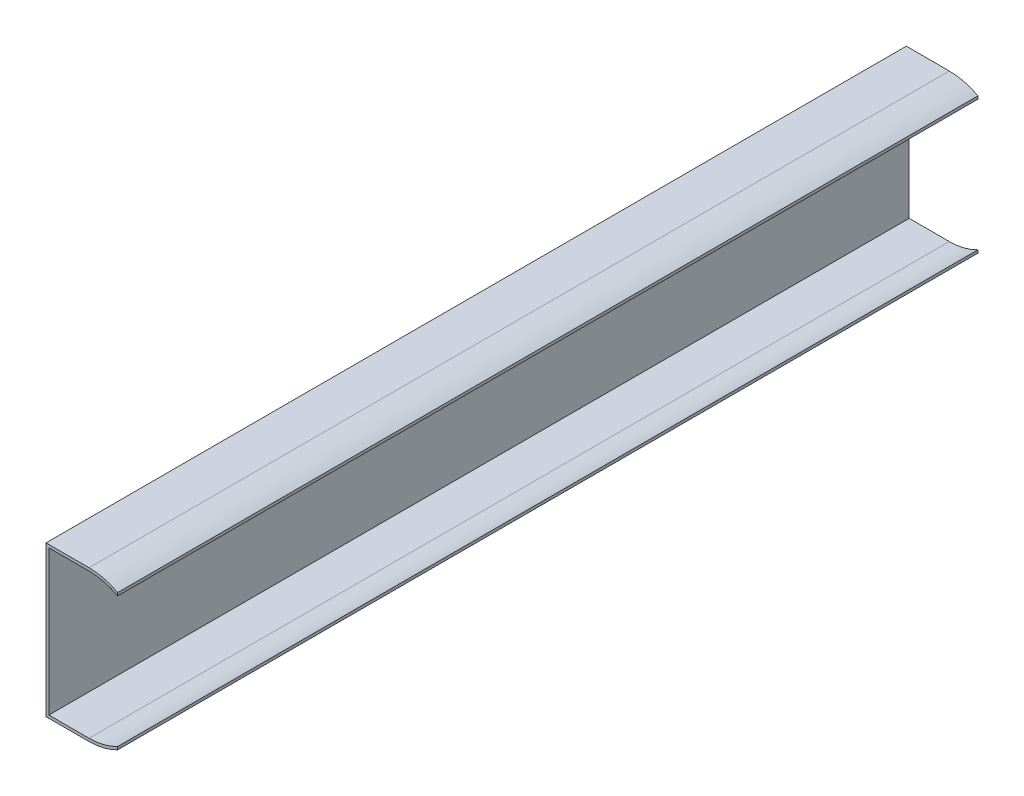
ISO-10303-21;
HEADER;
FILE_DESCRIPTION(('STEP AP214'),'2;1');
FILE_NAME('part.step','',(''),(''),'','','');
FILE_SCHEMA(('AUTOMOTIVE_DESIGN { 1 0 10303 214 1 1 1 1 }'));
ENDSEC;
DATA;
#1=APPLICATION_CONTEXT('core data for automotive mechanical design processes');
#2=APPLICATION_PROTOCOL_DEFINITION('international standard','automotive_design',2000,#1);
#3=PRODUCT_CONTEXT('',#1,'mechanical');
#4=PRODUCT('Part','Part','',(#3));
#5=PRODUCT_RELATED_PRODUCT_CATEGORY('part','',(#4));
#6=PRODUCT_DEFINITION_FORMATION('','',#4);
#7=PRODUCT_DEFINITION_CONTEXT('part definition',#1,'design');
#8=PRODUCT_DEFINITION('design','',#6,#7);
#9=PRODUCT_DEFINITION_SHAPE('','',#8);
#10=(LENGTH_UNIT() NAMED_UNIT(*) SI_UNIT(.MILLI.,.METRE.));
#11=(NAMED_UNIT(*) PLANE_ANGLE_UNIT() SI_UNIT($,.RADIAN.));
#12=(NAMED_UNIT(*) SI_UNIT($,.STERADIAN.) SOLID_ANGLE_UNIT());
#13=UNCERTAINTY_MEASURE_WITH_UNIT(LENGTH_MEASURE(1.E-05),#10,'distance_accuracy_value','');
#14=(GEOMETRIC_REPRESENTATION_CONTEXT(3) GLOBAL_UNCERTAINTY_ASSIGNED_CONTEXT((#13)) GLOBAL_UNIT_ASSIGNED_CONTEXT((#10,
#11,#12)) REPRESENTATION_CONTEXT('',''));
#15=CARTESIAN_POINT('',(0.,0.,0.));
#16=DIRECTION('',(0.,0.,1.));
#17=DIRECTION('',(1.,0.,0.));
#18=AXIS2_PLACEMENT_3D('',#15,#16,#17);
#19=CARTESIAN_POINT('',(0.,0.,600.));
#20=DIRECTION('',(0.,1.,0.));
#21=DIRECTION('',(0.,0.,1.));
#22=AXIS2_PLACEMENT_3D('',#19,#20,#21);
#23=PLANE('',#22);
#24=DIRECTION('',(1.,0.,0.));
#25=VECTOR('',#24,1.);
#26=CARTESIAN_POINT('',(0.,0.,0.));
#27=LINE('',#26,#25);
#28=CARTESIAN_POINT('',(0.,0.,0.));
#29=VERTEX_POINT('',#28);
#30=CARTESIAN_POINT('',(30.,0.,0.));
#31=VERTEX_POINT('',#30);
#32=EDGE_CURVE('E155',#29,#31,#27,.T.);
#33=ORIENTED_EDGE('',*,*,#32,.T.);
#34=DIRECTION('',(0.,0.,-1.));
#35=VECTOR('',#34,1.);
#36=CARTESIAN_POINT('',(30.,0.,600.));
#37=LINE('',#36,#35);
#38=CARTESIAN_POINT('',(30.,0.,600.));
#39=VERTEX_POINT('',#38);
#40=EDGE_CURVE('E11',#39,#31,#37,.T.);
#41=ORIENTED_EDGE('',*,*,#40,.F.);
#42=DIRECTION('',(1.,0.,0.));
#43=VECTOR('',#42,1.);
#44=CARTESIAN_POINT('',(0.,0.,600.));
#45=LINE('',#44,#43);
#46=CARTESIAN_POINT('',(0.,0.,600.));
#47=VERTEX_POINT('',#46);
#48=EDGE_CURVE('E197',#47,#39,#45,.T.);
#49=ORIENTED_EDGE('',*,*,#48,.F.);
#50=DIRECTION('',(0.,0.,-1.));
#51=VECTOR('',#50,1.);
#52=CARTESIAN_POINT('',(0.,0.,600.));
#53=LINE('',#52,#51);
#54=EDGE_CURVE('E148',#47,#29,#53,.T.);
#55=ORIENTED_EDGE('',*,*,#54,.T.);
#56=EDGE_LOOP('',(#33,#41,#49,#55));
#57=FACE_BOUND('',#56,.T.);
#58=ADVANCED_FACE('F32',(#57),#23,.F.);
#59=CARTESIAN_POINT('',(30.,0.,600.));
#60=CARTESIAN_POINT('',(40.6032812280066,0.0484567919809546,600.));
#61=CARTESIAN_POINT('',(50.,5.,600.));
#62=B_SPLINE_CURVE_WITH_KNOTS('',2,(#59,#60,#61),.UNSPECIFIED.,.F.,.F.,(3,3),(0.,1.),.UNSPECIFIED.);
#63=DIRECTION('',(0.,0.,-1.));
#64=VECTOR('',#63,1.);
#65=SURFACE_OF_LINEAR_EXTRUSION('',#62,#64);
#66=CARTESIAN_POINT('',(30.,0.,0.));
#67=CARTESIAN_POINT('',(40.6032812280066,0.0484567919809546,0.));
#68=CARTESIAN_POINT('',(50.,5.,0.));
#69=B_SPLINE_CURVE_WITH_KNOTS('',2,(#66,#67,#68),.UNSPECIFIED.,.F.,.F.,(3,3),(0.,1.),.UNSPECIFIED.);
#70=CARTESIAN_POINT('',(50.,5.,0.));
#71=VERTEX_POINT('',#70);
#72=EDGE_CURVE('E158',#31,#71,#69,.T.);
#73=ORIENTED_EDGE('',*,*,#72,.T.);
#74=DIRECTION('',(0.,0.,-1.));
#75=VECTOR('',#74,1.);
#76=CARTESIAN_POINT('',(50.,5.,600.));
#77=LINE('',#76,#75);
#78=CARTESIAN_POINT('',(50.,5.,600.));
#79=VERTEX_POINT('',#78);
#80=EDGE_CURVE('E40',#79,#71,#77,.T.);
#81=ORIENTED_EDGE('',*,*,#80,.F.);
#82=EDGE_CURVE('E103',#39,#79,#62,.T.);
#83=ORIENTED_EDGE('',*,*,#82,.F.);
#84=ORIENTED_EDGE('',*,*,#40,.T.);
#85=EDGE_LOOP('',(#73,#81,#83,#84));
#86=FACE_BOUND('',#85,.T.);
#87=ADVANCED_FACE('F281',(#86),#65,.F.);
#88=CARTESIAN_POINT('',(50.,5.,600.));
#89=DIRECTION('',(-1.,0.,0.));
#90=DIRECTION('',(0.,0.,1.));
#91=AXIS2_PLACEMENT_3D('',#88,#89,#90);
#92=PLANE('',#91);
#93=DIRECTION('',(0.,1.,0.));
#94=VECTOR('',#93,1.);
#95=CARTESIAN_POINT('',(50.,5.,0.));
#96=LINE('',#95,#94);
#97=CARTESIAN_POINT('',(50.,7.00000000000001,0.));
#98=VERTEX_POINT('',#97);
#99=EDGE_CURVE('E162',#71,#98,#96,.T.);
#100=ORIENTED_EDGE('',*,*,#99,.T.);
#101=DIRECTION('',(0.,0.,-1.));
#102=VECTOR('',#101,1.);
#103=CARTESIAN_POINT('',(50.,7.00000000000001,600.));
#104=LINE('',#103,#102);
#105=CARTESIAN_POINT('',(50.,7.00000000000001,600.));
#106=VERTEX_POINT('',#105);
#107=EDGE_CURVE('E216',#106,#98,#104,.T.);
#108=ORIENTED_EDGE('',*,*,#107,.F.);
#109=DIRECTION('',(0.,1.,0.));
#110=VECTOR('',#109,1.);
#111=CARTESIAN_POINT('',(50.,5.,600.));
#112=LINE('',#111,#110);
#113=EDGE_CURVE('E224',#79,#106,#112,.T.);
#114=ORIENTED_EDGE('',*,*,#113,.F.);
#115=ORIENTED_EDGE('',*,*,#80,.T.);
#116=EDGE_LOOP('',(#100,#108,#114,#115));
#117=FACE_BOUND('',#116,.T.);
#118=ADVANCED_FACE('F222',(#117),#92,.F.);
#119=CARTESIAN_POINT('',(50.,7.00000000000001,600.));
#120=CARTESIAN_POINT('',(40.6032812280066,2.04845679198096,600.));
#121=CARTESIAN_POINT('',(30.,2.,600.));
#122=B_SPLINE_CURVE_WITH_KNOTS('',2,(#119,#120,#121),.UNSPECIFIED.,.F.,.F.,(3,3),(0.,1.),.UNSPECIFIED.);
#123=DIRECTION('',(0.,0.,-1.));
#124=VECTOR('',#123,1.);
#125=SURFACE_OF_LINEAR_EXTRUSION('',#122,#124);
#126=CARTESIAN_POINT('',(50.,7.00000000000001,0.));
#127=CARTESIAN_POINT('',(40.6032812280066,2.04845679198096,0.));
#128=CARTESIAN_POINT('',(30.,2.,0.));
#129=B_SPLINE_CURVE_WITH_KNOTS('',2,(#126,#127,#128),.UNSPECIFIED.,.F.,.F.,(3,3),(0.,1.),.UNSPECIFIED.);
#130=CARTESIAN_POINT('',(30.,2.,0.));
#131=VERTEX_POINT('',#130);
#132=EDGE_CURVE('E167',#98,#131,#129,.T.);
#133=ORIENTED_EDGE('',*,*,#132,.T.);
#134=DIRECTION('',(0.,0.,-1.));
#135=VECTOR('',#134,1.);
#136=CARTESIAN_POINT('',(30.,2.,600.));
#137=LINE('',#136,#135);
#138=CARTESIAN_POINT('',(30.,2.,600.));
#139=VERTEX_POINT('',#138);
#140=EDGE_CURVE('E213',#139,#131,#137,.T.);
#141=ORIENTED_EDGE('',*,*,#140,.F.);
#142=EDGE_CURVE('E242',#106,#139,#122,.T.);
#143=ORIENTED_EDGE('',*,*,#142,.F.);
#144=ORIENTED_EDGE('',*,*,#107,.T.);
#145=EDGE_LOOP('',(#133,#141,#143,#144));
#146=FACE_BOUND('',#145,.T.);
#147=ADVANCED_FACE('F233',(#146),#125,.F.);
#148=CARTESIAN_POINT('',(2.,2.,600.));
#149=DIRECTION('',(0.,-1.,0.));
#150=DIRECTION('',(0.,0.,-1.));
#151=AXIS2_PLACEMENT_3D('',#148,#149,#150);
#152=PLANE('',#151);
#153=DIRECTION('',(-1.,0.,0.));
#154=VECTOR('',#153,1.);
#155=CARTESIAN_POINT('',(2.,2.,0.));
#156=LINE('',#155,#154);
#157=CARTESIAN_POINT('',(2.,2.,0.));
#158=VERTEX_POINT('',#157);
#159=EDGE_CURVE('E171',#131,#158,#156,.T.);
#160=ORIENTED_EDGE('',*,*,#159,.T.);
#161=DIRECTION('',(0.,0.,-1.));
#162=VECTOR('',#161,1.);
#163=CARTESIAN_POINT('',(2.,2.,600.));
#164=LINE('',#163,#162);
#165=CARTESIAN_POINT('',(2.,2.,600.));
#166=VERTEX_POINT('',#165);
#167=EDGE_CURVE('E210',#166,#158,#164,.T.);
#168=ORIENTED_EDGE('',*,*,#167,.F.);
#169=DIRECTION('',(-1.,0.,0.));
#170=VECTOR('',#169,1.);
#171=CARTESIAN_POINT('',(2.,2.,600.));
#172=LINE('',#171,#170);
#173=EDGE_CURVE('E239',#139,#166,#172,.T.);
#174=ORIENTED_EDGE('',*,*,#173,.F.);
#175=ORIENTED_EDGE('',*,*,#140,.T.);
#176=EDGE_LOOP('',(#160,#168,#174,#175));
#177=FACE_BOUND('',#176,.T.);
#178=ADVANCED_FACE('F237',(#177),#152,.F.);
#179=CARTESIAN_POINT('',(2.00000000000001,103.,600.));
#180=DIRECTION('',(-1.,0.,0.));
#181=DIRECTION('',(0.,-1.,0.));
#182=AXIS2_PLACEMENT_3D('',#179,#180,#181);
#183=PLANE('',#182);
#184=DIRECTION('',(0.,1.,0.));
#185=VECTOR('',#184,1.);
#186=CARTESIAN_POINT('',(2.00000000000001,103.,0.));
#187=LINE('',#186,#185);
#188=CARTESIAN_POINT('',(2.00000000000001,103.,0.));
#189=VERTEX_POINT('',#188);
#190=EDGE_CURVE('E176',#158,#189,#187,.T.);
#191=ORIENTED_EDGE('',*,*,#190,.T.);
#192=DIRECTION('',(0.,0.,-1.));
#193=VECTOR('',#192,1.);
#194=CARTESIAN_POINT('',(2.00000000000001,103.,600.));
#195=LINE('',#194,#193);
#196=CARTESIAN_POINT('',(2.00000000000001,103.,600.));
#197=VERTEX_POINT('',#196);
#198=EDGE_CURVE('E207',#197,#189,#195,.T.);
#199=ORIENTED_EDGE('',*,*,#198,.F.);
#200=DIRECTION('',(0.,1.,0.));
#201=VECTOR('',#200,1.);
#202=CARTESIAN_POINT('',(2.00000000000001,103.,600.));
#203=LINE('',#202,#201);
#204=EDGE_CURVE('E241',#166,#197,#203,.T.);
#205=ORIENTED_EDGE('',*,*,#204,.F.);
#206=ORIENTED_EDGE('',*,*,#167,.T.);
#207=EDGE_LOOP('',(#191,#199,#205,#206));
#208=FACE_BOUND('',#207,.T.);
#209=ADVANCED_FACE('F271',(#208),#183,.F.);
#210=CARTESIAN_POINT('',(2.00000000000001,103.,600.));
#211=DIRECTION('',(0.,1.,0.));
#212=DIRECTION('',(0.,0.,1.));
#213=AXIS2_PLACEMENT_3D('',#210,#211,#212);
#214=PLANE('',#213);
#215=DIRECTION('',(1.,0.,0.));
#216=VECTOR('',#215,1.);
#217=CARTESIAN_POINT('',(2.00000000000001,103.,0.));
#218=LINE('',#217,#216);
#219=CARTESIAN_POINT('',(30.,103.,0.));
#220=VERTEX_POINT('',#219);
#221=EDGE_CURVE('E178',#189,#220,#218,.T.);
#222=ORIENTED_EDGE('',*,*,#221,.T.);
#223=DIRECTION('',(0.,0.,-1.));
#224=VECTOR('',#223,1.);
#225=CARTESIAN_POINT('',(30.,103.,600.));
#226=LINE('',#225,#224);
#227=CARTESIAN_POINT('',(30.,103.,600.));
#228=VERTEX_POINT('',#227);
#229=EDGE_CURVE('E204',#228,#220,#226,.T.);
#230=ORIENTED_EDGE('',*,*,#229,.F.);
#231=DIRECTION('',(1.,0.,0.));
#232=VECTOR('',#231,1.);
#233=CARTESIAN_POINT('',(2.00000000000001,103.,600.));
#234=LINE('',#233,#232);
#235=EDGE_CURVE('E244',#197,#228,#234,.T.);
#236=ORIENTED_EDGE('',*,*,#235,.F.);
#237=ORIENTED_EDGE('',*,*,#198,.T.);
#238=EDGE_LOOP('',(#222,#230,#236,#237));
#239=FACE_BOUND('',#238,.T.);
#240=ADVANCED_FACE('F266',(#239),#214,.F.);
#241=CARTESIAN_POINT('',(30.,103.,600.));
#242=CARTESIAN_POINT('',(40.6032812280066,102.951543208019,600.));
#243=CARTESIAN_POINT('',(50.,98.,600.));
#244=B_SPLINE_CURVE_WITH_KNOTS('',2,(#241,#242,#243),.UNSPECIFIED.,.F.,.F.,(3,3),(0.,1.),.UNSPECIFIED.);
#245=DIRECTION('',(0.,0.,-1.));
#246=VECTOR('',#245,1.);
#247=SURFACE_OF_LINEAR_EXTRUSION('',#244,#246);
#248=CARTESIAN_POINT('',(30.,103.,0.));
#249=CARTESIAN_POINT('',(40.6032812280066,102.951543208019,0.));
#250=CARTESIAN_POINT('',(50.,98.,0.));
#251=B_SPLINE_CURVE_WITH_KNOTS('',2,(#248,#249,#250),.UNSPECIFIED.,.F.,.F.,(3,3),(0.,1.),.UNSPECIFIED.);
#252=CARTESIAN_POINT('',(50.,98.,0.));
#253=VERTEX_POINT('',#252);
#254=EDGE_CURVE('E180',#220,#253,#251,.T.);
#255=ORIENTED_EDGE('',*,*,#254,.T.);
#256=DIRECTION('',(0.,0.,-1.));
#257=VECTOR('',#256,1.);
#258=CARTESIAN_POINT('',(50.,98.,600.));
#259=LINE('',#258,#257);
#260=CARTESIAN_POINT('',(50.,98.,600.));
#261=VERTEX_POINT('',#260);
#262=EDGE_CURVE('E201',#261,#253,#259,.T.);
#263=ORIENTED_EDGE('',*,*,#262,.F.);
#264=EDGE_CURVE('E253',#228,#261,#244,.T.);
#265=ORIENTED_EDGE('',*,*,#264,.F.);
#266=ORIENTED_EDGE('',*,*,#229,.T.);
#267=EDGE_LOOP('',(#255,#263,#265,#266));
#268=FACE_BOUND('',#267,.T.);
#269=ADVANCED_FACE('F261',(#268),#247,.F.);
#270=CARTESIAN_POINT('',(50.,100.,600.));
#271=DIRECTION('',(-1.,0.,0.));
#272=DIRECTION('',(0.,0.,1.));
#273=AXIS2_PLACEMENT_3D('',#270,#271,#272);
#274=PLANE('',#273);
#275=DIRECTION('',(0.,1.,0.));
#276=VECTOR('',#275,1.);
#277=CARTESIAN_POINT('',(50.,100.,0.));
#278=LINE('',#277,#276);
#279=CARTESIAN_POINT('',(50.,100.,0.));
#280=VERTEX_POINT('',#279);
#281=EDGE_CURVE('E184',#253,#280,#278,.T.);
#282=ORIENTED_EDGE('',*,*,#281,.T.);
#283=DIRECTION('',(0.,0.,-1.));
#284=VECTOR('',#283,1.);
#285=CARTESIAN_POINT('',(50.,100.,600.));
#286=LINE('',#285,#284);
#287=CARTESIAN_POINT('',(50.,100.,600.));
#288=VERTEX_POINT('',#287);
#289=EDGE_CURVE('E143',#288,#280,#286,.T.);
#290=ORIENTED_EDGE('',*,*,#289,.F.);
#291=DIRECTION('',(0.,1.,0.));
#292=VECTOR('',#291,1.);
#293=CARTESIAN_POINT('',(50.,100.,600.));
#294=LINE('',#293,#292);
#295=EDGE_CURVE('E134',#261,#288,#294,.T.);
#296=ORIENTED_EDGE('',*,*,#295,.F.);
#297=ORIENTED_EDGE('',*,*,#262,.T.);
#298=EDGE_LOOP('',(#282,#290,#296,#297));
#299=FACE_BOUND('',#298,.T.);
#300=ADVANCED_FACE('F265',(#299),#274,.F.);
#301=CARTESIAN_POINT('',(50.,100.,600.));
#302=CARTESIAN_POINT('',(40.6032812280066,104.951543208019,600.));
#303=CARTESIAN_POINT('',(30.,105.,600.));
#304=B_SPLINE_CURVE_WITH_KNOTS('',2,(#301,#302,#303),.UNSPECIFIED.,.F.,.F.,(3,3),(0.,1.),.UNSPECIFIED.);
#305=DIRECTION('',(0.,0.,-1.));
#306=VECTOR('',#305,1.);
#307=SURFACE_OF_LINEAR_EXTRUSION('',#304,#306);
#308=CARTESIAN_POINT('',(50.,100.,0.));
#309=CARTESIAN_POINT('',(40.6032812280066,104.951543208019,0.));
#310=CARTESIAN_POINT('',(30.,105.,0.));
#311=B_SPLINE_CURVE_WITH_KNOTS('',2,(#308,#309,#310),.UNSPECIFIED.,.F.,.F.,(3,3),(0.,1.),.UNSPECIFIED.);
#312=CARTESIAN_POINT('',(30.,105.,0.));
#313=VERTEX_POINT('',#312);
#314=EDGE_CURVE('E142',#280,#313,#311,.T.);
#315=ORIENTED_EDGE('',*,*,#314,.T.);
#316=DIRECTION('',(0.,0.,-1.));
#317=VECTOR('',#316,1.);
#318=CARTESIAN_POINT('',(30.,105.,600.));
#319=LINE('',#318,#317);
#320=CARTESIAN_POINT('',(30.,105.,600.));
#321=VERTEX_POINT('',#320);
#322=EDGE_CURVE('E139',#321,#313,#319,.T.);
#323=ORIENTED_EDGE('',*,*,#322,.F.);
#324=EDGE_CURVE('E128',#288,#321,#304,.T.);
#325=ORIENTED_EDGE('',*,*,#324,.F.);
#326=ORIENTED_EDGE('',*,*,#289,.T.);
#327=EDGE_LOOP('',(#315,#323,#325,#326));
#328=FACE_BOUND('',#327,.T.);
#329=ADVANCED_FACE('F140',(#328),#307,.F.);
#330=CARTESIAN_POINT('',(0.,105.,600.));
#331=DIRECTION('',(0.,-1.,0.));
#332=DIRECTION('',(0.,0.,-1.));
#333=AXIS2_PLACEMENT_3D('',#330,#331,#332);
#334=PLANE('',#333);
#335=DIRECTION('',(-1.,0.,0.));
#336=VECTOR('',#335,1.);
#337=CARTESIAN_POINT('',(0.,105.,0.));
#338=LINE('',#337,#336);
#339=CARTESIAN_POINT('',(0.,105.,0.));
#340=VERTEX_POINT('',#339);
#341=EDGE_CURVE('E89',#313,#340,#338,.T.);
#342=ORIENTED_EDGE('',*,*,#341,.T.);
#343=DIRECTION('',(0.,0.,-1.));
#344=VECTOR('',#343,1.);
#345=CARTESIAN_POINT('',(0.,105.,600.));
#346=LINE('',#345,#344);
#347=CARTESIAN_POINT('',(0.,105.,600.));
#348=VERTEX_POINT('',#347);
#349=EDGE_CURVE('E144',#348,#340,#346,.T.);
#350=ORIENTED_EDGE('',*,*,#349,.F.);
#351=DIRECTION('',(-1.,0.,0.));
#352=VECTOR('',#351,1.);
#353=CARTESIAN_POINT('',(0.,105.,600.));
#354=LINE('',#353,#352);
#355=EDGE_CURVE('E132',#321,#348,#354,.T.);
#356=ORIENTED_EDGE('',*,*,#355,.F.);
#357=ORIENTED_EDGE('',*,*,#322,.T.);
#358=EDGE_LOOP('',(#342,#350,#356,#357));
#359=FACE_BOUND('',#358,.T.);
#360=ADVANCED_FACE('F146',(#359),#334,.F.);
#361=CARTESIAN_POINT('',(0.,0.,600.));
#362=DIRECTION('',(1.,0.,0.));
#363=DIRECTION('',(0.,0.,-1.));
#364=AXIS2_PLACEMENT_3D('',#361,#362,#363);
#365=PLANE('',#364);
#366=DIRECTION('',(0.,-1.,0.));
#367=VECTOR('',#366,1.);
#368=CARTESIAN_POINT('',(0.,0.,0.));
#369=LINE('',#368,#367);
#370=EDGE_CURVE('E95',#340,#29,#369,.T.);
#371=ORIENTED_EDGE('',*,*,#370,.T.);
#372=ORIENTED_EDGE('',*,*,#54,.F.);
#373=DIRECTION('',(0.,-1.,0.));
#374=VECTOR('',#373,1.);
#375=CARTESIAN_POINT('',(0.,0.,600.));
#376=LINE('',#375,#374);
#377=EDGE_CURVE('E48',#348,#47,#376,.T.);
#378=ORIENTED_EDGE('',*,*,#377,.F.);
#379=ORIENTED_EDGE('',*,*,#349,.T.);
#380=EDGE_LOOP('',(#371,#372,#378,#379));
#381=FACE_BOUND('',#380,.T.);
#382=ADVANCED_FACE('F357',(#381),#365,.F.);
#383=CARTESIAN_POINT('',(40.3016406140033,1.27422839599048,600.));
#384=DIRECTION('',(0.,0.,-1.));
#385=DIRECTION('',(-1.,0.,0.));
#386=AXIS2_PLACEMENT_3D('',#383,#384,#385);
#387=PLANE('',#386);
#388=ORIENTED_EDGE('',*,*,#48,.T.);
#389=ORIENTED_EDGE('',*,*,#82,.T.);
#390=ORIENTED_EDGE('',*,*,#113,.T.);
#391=ORIENTED_EDGE('',*,*,#142,.T.);
#392=ORIENTED_EDGE('',*,*,#173,.T.);
#393=ORIENTED_EDGE('',*,*,#204,.T.);
#394=ORIENTED_EDGE('',*,*,#235,.T.);
#395=ORIENTED_EDGE('',*,*,#264,.T.);
#396=ORIENTED_EDGE('',*,*,#295,.T.);
#397=ORIENTED_EDGE('',*,*,#324,.T.);
#398=ORIENTED_EDGE('',*,*,#355,.T.);
#399=ORIENTED_EDGE('',*,*,#377,.T.);
#400=EDGE_LOOP('',(#388,#389,#390,#391,#392,#393,#394,#395,#396,#397,#398,#399));
#401=FACE_BOUND('',#400,.T.);
#402=ADVANCED_FACE('F130',(#401),#387,.F.);
#403=CARTESIAN_POINT('',(40.3016406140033,1.27422839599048,0.));
#404=DIRECTION('',(0.,0.,-1.));
#405=DIRECTION('',(-1.,0.,0.));
#406=AXIS2_PLACEMENT_3D('',#403,#404,#405);
#407=PLANE('',#406);
#408=ORIENTED_EDGE('',*,*,#32,.F.);
#409=ORIENTED_EDGE('',*,*,#370,.F.);
#410=ORIENTED_EDGE('',*,*,#341,.F.);
#411=ORIENTED_EDGE('',*,*,#314,.F.);
#412=ORIENTED_EDGE('',*,*,#281,.F.);
#413=ORIENTED_EDGE('',*,*,#254,.F.);
#414=ORIENTED_EDGE('',*,*,#221,.F.);
#415=ORIENTED_EDGE('',*,*,#190,.F.);
#416=ORIENTED_EDGE('',*,*,#159,.F.);
#417=ORIENTED_EDGE('',*,*,#132,.F.);
#418=ORIENTED_EDGE('',*,*,#99,.F.);
#419=ORIENTED_EDGE('',*,*,#72,.F.);
#420=EDGE_LOOP('',(#408,#409,#410,#411,#412,#413,#414,#415,#416,#417,#418,#419));
#421=FACE_BOUND('',#420,.T.);
#422=ADVANCED_FACE('F228',(#421),#407,.T.);
#423=CLOSED_SHELL('',(#58,#87,#118,#147,#178,#209,#240,#269,#300,#329,#360,#382,#402,#422));
#424=MANIFOLD_SOLID_BREP('B2',#423);
#425=ADVANCED_BREP_SHAPE_REPRESENTATION('',(#18,#424),#14);
#426=SHAPE_DEFINITION_REPRESENTATION(#9,#425);
ENDSEC;
END-ISO-10303-21;
